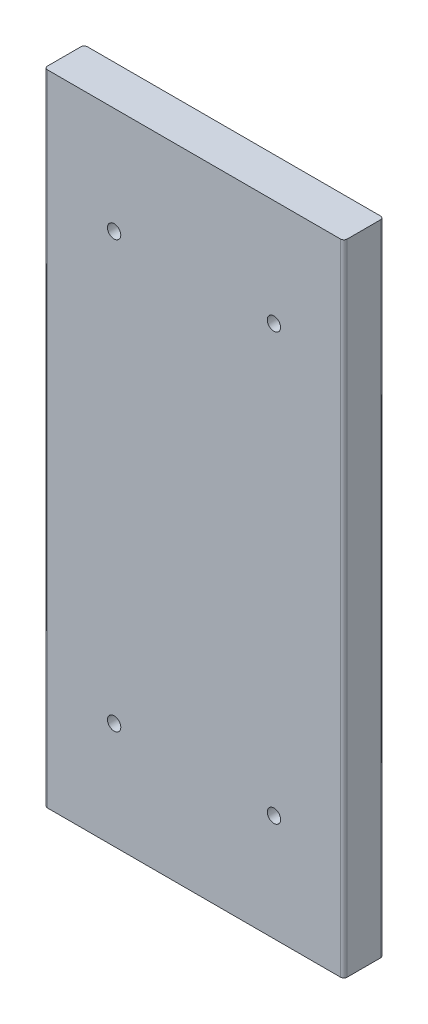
ISO-10303-21;
HEADER;
FILE_DESCRIPTION(('STEP AP214'),'2;1');
FILE_NAME('part.step','',(''),(''),'','','');
FILE_SCHEMA(('AUTOMOTIVE_DESIGN { 1 0 10303 214 1 1 1 1 }'));
ENDSEC;
DATA;
#1=APPLICATION_CONTEXT('core data for automotive mechanical design processes');
#2=APPLICATION_PROTOCOL_DEFINITION('international standard','automotive_design',2000,#1);
#3=PRODUCT_CONTEXT('',#1,'mechanical');
#4=PRODUCT('Part','Part','',(#3));
#5=PRODUCT_RELATED_PRODUCT_CATEGORY('part','',(#4));
#6=PRODUCT_DEFINITION_FORMATION('','',#4);
#7=PRODUCT_DEFINITION_CONTEXT('part definition',#1,'design');
#8=PRODUCT_DEFINITION('design','',#6,#7);
#9=PRODUCT_DEFINITION_SHAPE('','',#8);
#10=(LENGTH_UNIT() NAMED_UNIT(*) SI_UNIT(.MILLI.,.METRE.));
#11=(NAMED_UNIT(*) PLANE_ANGLE_UNIT() SI_UNIT($,.RADIAN.));
#12=(NAMED_UNIT(*) SI_UNIT($,.STERADIAN.) SOLID_ANGLE_UNIT());
#13=UNCERTAINTY_MEASURE_WITH_UNIT(LENGTH_MEASURE(1.E-05),#10,'distance_accuracy_value','');
#14=(GEOMETRIC_REPRESENTATION_CONTEXT(3) GLOBAL_UNCERTAINTY_ASSIGNED_CONTEXT((#13)) GLOBAL_UNIT_ASSIGNED_CONTEXT((#10,
#11,#12)) REPRESENTATION_CONTEXT('',''));
#15=CARTESIAN_POINT('',(0.,0.,0.));
#16=DIRECTION('',(0.,0.,1.));
#17=DIRECTION('',(1.,0.,0.));
#18=AXIS2_PLACEMENT_3D('',#15,#16,#17);
#19=CARTESIAN_POINT('',(0.,0.,38.1));
#20=DIRECTION('',(0.,0.,-1.));
#21=DIRECTION('',(-1.,0.,0.));
#22=AXIS2_PLACEMENT_3D('',#19,#20,#21);
#23=PLANE('',#22);
#24=DIRECTION('',(-1.,0.,0.));
#25=VECTOR('',#24,1.);
#26=CARTESIAN_POINT('',(0.,609.6,38.1));
#27=LINE('',#26,#25);
#28=CARTESIAN_POINT('',(282.575,609.6,38.1));
#29=VERTEX_POINT('',#28);
#30=CARTESIAN_POINT('',(3.175,609.6,38.1));
#31=VERTEX_POINT('',#30);
#32=EDGE_CURVE('E190',#29,#31,#27,.T.);
#33=ORIENTED_EDGE('',*,*,#32,.T.);
#34=DIRECTION('',(0.,-1.,0.));
#35=VECTOR('',#34,1.);
#36=CARTESIAN_POINT('',(3.175,0.,38.1));
#37=LINE('',#36,#35);
#38=CARTESIAN_POINT('',(3.175,0.,38.1));
#39=VERTEX_POINT('',#38);
#40=EDGE_CURVE('E172',#31,#39,#37,.T.);
#41=ORIENTED_EDGE('',*,*,#40,.T.);
#42=DIRECTION('',(1.,0.,0.));
#43=VECTOR('',#42,1.);
#44=CARTESIAN_POINT('',(0.,0.,38.1));
#45=LINE('',#44,#43);
#46=CARTESIAN_POINT('',(282.575,0.,38.1));
#47=VERTEX_POINT('',#46);
#48=EDGE_CURVE('E117',#39,#47,#45,.T.);
#49=ORIENTED_EDGE('',*,*,#48,.T.);
#50=DIRECTION('',(0.,1.,0.));
#51=VECTOR('',#50,1.);
#52=CARTESIAN_POINT('',(282.575,0.,38.1));
#53=LINE('',#52,#51);
#54=EDGE_CURVE('E168',#47,#29,#53,.T.);
#55=ORIENTED_EDGE('',*,*,#54,.T.);
#56=EDGE_LOOP('',(#33,#41,#49,#55));
#57=FACE_BOUND('',#56,.T.);
#58=CARTESIAN_POINT('',(66.675,508.,38.1));
#59=DIRECTION('',(0.,0.,1.));
#60=DIRECTION('',(1.,0.,0.));
#61=AXIS2_PLACEMENT_3D('',#58,#59,#60);
#62=CIRCLE('',#61,6.35000000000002);
#63=CARTESIAN_POINT('',(60.325,508.,38.1));
#64=VERTEX_POINT('',#63);
#65=EDGE_CURVE('E206',#64,#64,#62,.T.);
#66=ORIENTED_EDGE('',*,*,#65,.F.);
#67=EDGE_LOOP('',(#66));
#68=FACE_BOUND('',#67,.T.);
#69=CARTESIAN_POINT('',(66.675,101.6,38.1));
#70=DIRECTION('',(0.,0.,1.));
#71=DIRECTION('',(1.,0.,0.));
#72=AXIS2_PLACEMENT_3D('',#69,#70,#71);
#73=CIRCLE('',#72,6.35000000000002);
#74=CARTESIAN_POINT('',(60.325,101.6,38.1));
#75=VERTEX_POINT('',#74);
#76=EDGE_CURVE('E270',#75,#75,#73,.T.);
#77=ORIENTED_EDGE('',*,*,#76,.F.);
#78=EDGE_LOOP('',(#77));
#79=FACE_BOUND('',#78,.T.);
#80=CARTESIAN_POINT('',(219.075,508.,38.1));
#81=DIRECTION('',(0.,0.,1.));
#82=DIRECTION('',(1.,0.,0.));
#83=AXIS2_PLACEMENT_3D('',#80,#81,#82);
#84=CIRCLE('',#83,6.34999999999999);
#85=CARTESIAN_POINT('',(212.725,508.,38.1));
#86=VERTEX_POINT('',#85);
#87=EDGE_CURVE('E275',#86,#86,#84,.T.);
#88=ORIENTED_EDGE('',*,*,#87,.F.);
#89=EDGE_LOOP('',(#88));
#90=FACE_BOUND('',#89,.T.);
#91=CARTESIAN_POINT('',(219.075,101.6,38.1));
#92=DIRECTION('',(0.,0.,1.));
#93=DIRECTION('',(1.,0.,0.));
#94=AXIS2_PLACEMENT_3D('',#91,#92,#93);
#95=CIRCLE('',#94,6.34999999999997);
#96=CARTESIAN_POINT('',(212.725,101.6,38.1));
#97=VERTEX_POINT('',#96);
#98=EDGE_CURVE('E299',#97,#97,#95,.T.);
#99=ORIENTED_EDGE('',*,*,#98,.F.);
#100=EDGE_LOOP('',(#99));
#101=FACE_BOUND('',#100,.T.);
#102=ADVANCED_FACE('F45',(#57,#68,#79,#90,#101),#23,.F.);
#103=CARTESIAN_POINT('',(0.,0.,0.));
#104=DIRECTION('',(0.,0.,-1.));
#105=DIRECTION('',(-1.,0.,0.));
#106=AXIS2_PLACEMENT_3D('',#103,#104,#105);
#107=PLANE('',#106);
#108=CARTESIAN_POINT('',(219.075,508.,0.));
#109=DIRECTION('',(0.,0.,1.));
#110=DIRECTION('',(1.,0.,0.));
#111=AXIS2_PLACEMENT_3D('',#108,#109,#110);
#112=CIRCLE('',#111,6.34999999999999);
#113=CARTESIAN_POINT('',(212.725,508.,0.));
#114=VERTEX_POINT('',#113);
#115=EDGE_CURVE('E282',#114,#114,#112,.T.);
#116=ORIENTED_EDGE('',*,*,#115,.T.);
#117=EDGE_LOOP('',(#116));
#118=FACE_BOUND('',#117,.T.);
#119=CARTESIAN_POINT('',(66.675,508.,0.));
#120=DIRECTION('',(0.,0.,1.));
#121=DIRECTION('',(1.,0.,0.));
#122=AXIS2_PLACEMENT_3D('',#119,#120,#121);
#123=CIRCLE('',#122,6.35000000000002);
#124=CARTESIAN_POINT('',(60.325,508.,0.));
#125=VERTEX_POINT('',#124);
#126=EDGE_CURVE('E279',#125,#125,#123,.T.);
#127=ORIENTED_EDGE('',*,*,#126,.T.);
#128=EDGE_LOOP('',(#127));
#129=FACE_BOUND('',#128,.T.);
#130=DIRECTION('',(1.,0.,0.));
#131=VECTOR('',#130,1.);
#132=CARTESIAN_POINT('',(0.,0.,0.));
#133=LINE('',#132,#131);
#134=CARTESIAN_POINT('',(3.175,0.,0.));
#135=VERTEX_POINT('',#134);
#136=CARTESIAN_POINT('',(282.575,0.,0.));
#137=VERTEX_POINT('',#136);
#138=EDGE_CURVE('E203',#135,#137,#133,.T.);
#139=ORIENTED_EDGE('',*,*,#138,.F.);
#140=DIRECTION('',(0.,-1.,0.));
#141=VECTOR('',#140,1.);
#142=CARTESIAN_POINT('',(3.175,609.6,0.));
#143=LINE('',#142,#141);
#144=CARTESIAN_POINT('',(3.175,609.6,0.));
#145=VERTEX_POINT('',#144);
#146=EDGE_CURVE('E156',#135,#145,#143,.F.);
#147=ORIENTED_EDGE('',*,*,#146,.T.);
#148=DIRECTION('',(-1.,0.,0.));
#149=VECTOR('',#148,1.);
#150=CARTESIAN_POINT('',(0.,609.6,0.));
#151=LINE('',#150,#149);
#152=CARTESIAN_POINT('',(282.575,609.6,0.));
#153=VERTEX_POINT('',#152);
#154=EDGE_CURVE('E199',#153,#145,#151,.T.);
#155=ORIENTED_EDGE('',*,*,#154,.F.);
#156=DIRECTION('',(0.,1.,0.));
#157=VECTOR('',#156,1.);
#158=CARTESIAN_POINT('',(282.575,0.,0.));
#159=LINE('',#158,#157);
#160=EDGE_CURVE('E153',#153,#137,#159,.F.);
#161=ORIENTED_EDGE('',*,*,#160,.T.);
#162=EDGE_LOOP('',(#139,#147,#155,#161));
#163=FACE_BOUND('',#162,.T.);
#164=CARTESIAN_POINT('',(66.675,101.6,0.));
#165=DIRECTION('',(0.,0.,1.));
#166=DIRECTION('',(1.,0.,0.));
#167=AXIS2_PLACEMENT_3D('',#164,#165,#166);
#168=CIRCLE('',#167,6.35000000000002);
#169=CARTESIAN_POINT('',(60.325,101.6,0.));
#170=VERTEX_POINT('',#169);
#171=EDGE_CURVE('E273',#170,#170,#168,.T.);
#172=ORIENTED_EDGE('',*,*,#171,.T.);
#173=EDGE_LOOP('',(#172));
#174=FACE_BOUND('',#173,.T.);
#175=CARTESIAN_POINT('',(219.075,101.6,0.));
#176=DIRECTION('',(0.,0.,1.));
#177=DIRECTION('',(1.,0.,0.));
#178=AXIS2_PLACEMENT_3D('',#175,#176,#177);
#179=CIRCLE('',#178,6.34999999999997);
#180=CARTESIAN_POINT('',(212.725,101.6,0.));
#181=VERTEX_POINT('',#180);
#182=EDGE_CURVE('E301',#181,#181,#179,.T.);
#183=ORIENTED_EDGE('',*,*,#182,.T.);
#184=EDGE_LOOP('',(#183));
#185=FACE_BOUND('',#184,.T.);
#186=ADVANCED_FACE('F214',(#118,#129,#163,#174,#185),#107,.T.);
#187=CARTESIAN_POINT('',(0.,0.,38.1));
#188=DIRECTION('',(1.,0.,0.));
#189=DIRECTION('',(0.,0.,-1.));
#190=AXIS2_PLACEMENT_3D('',#187,#188,#189);
#191=PLANE('',#190);
#192=DIRECTION('',(0.,0.,-1.));
#193=VECTOR('',#192,1.);
#194=CARTESIAN_POINT('',(0.,609.6,38.1));
#195=LINE('',#194,#193);
#196=CARTESIAN_POINT('',(0.,609.6,34.925));
#197=VERTEX_POINT('',#196);
#198=CARTESIAN_POINT('',(0.,609.6,3.17500000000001));
#199=VERTEX_POINT('',#198);
#200=EDGE_CURVE('E194',#197,#199,#195,.T.);
#201=ORIENTED_EDGE('',*,*,#200,.T.);
#202=DIRECTION('',(0.,-1.,0.));
#203=VECTOR('',#202,1.);
#204=CARTESIAN_POINT('',(0.,0.,3.175));
#205=LINE('',#204,#203);
#206=CARTESIAN_POINT('',(0.,0.,3.17500000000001));
#207=VERTEX_POINT('',#206);
#208=EDGE_CURVE('E133',#199,#207,#205,.T.);
#209=ORIENTED_EDGE('',*,*,#208,.T.);
#210=DIRECTION('',(0.,0.,-1.));
#211=VECTOR('',#210,1.);
#212=CARTESIAN_POINT('',(0.,0.,38.1));
#213=LINE('',#212,#211);
#214=CARTESIAN_POINT('',(0.,0.,34.925));
#215=VERTEX_POINT('',#214);
#216=EDGE_CURVE('E115',#215,#207,#213,.T.);
#217=ORIENTED_EDGE('',*,*,#216,.F.);
#218=DIRECTION('',(0.,-1.,0.));
#219=VECTOR('',#218,1.);
#220=CARTESIAN_POINT('',(0.,0.,34.925));
#221=LINE('',#220,#219);
#222=EDGE_CURVE('E130',#215,#197,#221,.F.);
#223=ORIENTED_EDGE('',*,*,#222,.T.);
#224=EDGE_LOOP('',(#201,#209,#217,#223));
#225=FACE_BOUND('',#224,.T.);
#226=ADVANCED_FACE('F129',(#225),#191,.F.);
#227=CARTESIAN_POINT('',(0.,0.,38.1));
#228=DIRECTION('',(0.,1.,0.));
#229=DIRECTION('',(0.,0.,1.));
#230=AXIS2_PLACEMENT_3D('',#227,#228,#229);
#231=PLANE('',#230);
#232=ORIENTED_EDGE('',*,*,#216,.T.);
#233=CARTESIAN_POINT('',(3.175,0.,3.175));
#234=DIRECTION('',(0.,1.,0.));
#235=DIRECTION('',(0.,0.,1.));
#236=AXIS2_PLACEMENT_3D('',#233,#234,#235);
#237=CIRCLE('',#236,3.175);
#238=EDGE_CURVE('E123',#207,#135,#237,.F.);
#239=ORIENTED_EDGE('',*,*,#238,.T.);
#240=ORIENTED_EDGE('',*,*,#138,.T.);
#241=CARTESIAN_POINT('',(282.575,0.,3.175));
#242=DIRECTION('',(0.,1.,0.));
#243=DIRECTION('',(0.,0.,1.));
#244=AXIS2_PLACEMENT_3D('',#241,#242,#243);
#245=CIRCLE('',#244,3.175);
#246=CARTESIAN_POINT('',(285.75,0.,3.17500000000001));
#247=VERTEX_POINT('',#246);
#248=EDGE_CURVE('E124',#137,#247,#245,.F.);
#249=ORIENTED_EDGE('',*,*,#248,.T.);
#250=DIRECTION('',(0.,0.,-1.));
#251=VECTOR('',#250,1.);
#252=CARTESIAN_POINT('',(285.75,0.,38.1));
#253=LINE('',#252,#251);
#254=CARTESIAN_POINT('',(285.75,0.,34.925));
#255=VERTEX_POINT('',#254);
#256=EDGE_CURVE('E135',#255,#247,#253,.T.);
#257=ORIENTED_EDGE('',*,*,#256,.F.);
#258=CARTESIAN_POINT('',(282.575,0.,34.925));
#259=DIRECTION('',(0.,1.,0.));
#260=DIRECTION('',(0.,0.,1.));
#261=AXIS2_PLACEMENT_3D('',#258,#259,#260);
#262=CIRCLE('',#261,3.175);
#263=EDGE_CURVE('E143',#255,#47,#262,.F.);
#264=ORIENTED_EDGE('',*,*,#263,.T.);
#265=ORIENTED_EDGE('',*,*,#48,.F.);
#266=CARTESIAN_POINT('',(3.175,0.,34.925));
#267=DIRECTION('',(0.,1.,0.));
#268=DIRECTION('',(0.,0.,1.));
#269=AXIS2_PLACEMENT_3D('',#266,#267,#268);
#270=CIRCLE('',#269,3.175);
#271=EDGE_CURVE('E112',#39,#215,#270,.F.);
#272=ORIENTED_EDGE('',*,*,#271,.T.);
#273=EDGE_LOOP('',(#232,#239,#240,#249,#257,#264,#265,#272));
#274=FACE_BOUND('',#273,.T.);
#275=ADVANCED_FACE('F114',(#274),#231,.F.);
#276=CARTESIAN_POINT('',(285.75,0.,38.1));
#277=DIRECTION('',(-1.,0.,0.));
#278=DIRECTION('',(0.,0.,1.));
#279=AXIS2_PLACEMENT_3D('',#276,#277,#278);
#280=PLANE('',#279);
#281=ORIENTED_EDGE('',*,*,#256,.T.);
#282=DIRECTION('',(0.,1.,0.));
#283=VECTOR('',#282,1.);
#284=CARTESIAN_POINT('',(285.75,609.6,3.175));
#285=LINE('',#284,#283);
#286=CARTESIAN_POINT('',(285.75,609.6,3.17500000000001));
#287=VERTEX_POINT('',#286);
#288=EDGE_CURVE('E11',#247,#287,#285,.T.);
#289=ORIENTED_EDGE('',*,*,#288,.T.);
#290=DIRECTION('',(0.,0.,-1.));
#291=VECTOR('',#290,1.);
#292=CARTESIAN_POINT('',(285.75,609.6,38.1));
#293=LINE('',#292,#291);
#294=CARTESIAN_POINT('',(285.75,609.6,34.925));
#295=VERTEX_POINT('',#294);
#296=EDGE_CURVE('E180',#295,#287,#293,.T.);
#297=ORIENTED_EDGE('',*,*,#296,.F.);
#298=DIRECTION('',(0.,1.,0.));
#299=VECTOR('',#298,1.);
#300=CARTESIAN_POINT('',(285.75,0.,34.925));
#301=LINE('',#300,#299);
#302=EDGE_CURVE('E54',#295,#255,#301,.F.);
#303=ORIENTED_EDGE('',*,*,#302,.T.);
#304=EDGE_LOOP('',(#281,#289,#297,#303));
#305=FACE_BOUND('',#304,.T.);
#306=ADVANCED_FACE('F179',(#305),#280,.F.);
#307=CARTESIAN_POINT('',(0.,609.6,38.1));
#308=DIRECTION('',(0.,-1.,0.));
#309=DIRECTION('',(0.,0.,-1.));
#310=AXIS2_PLACEMENT_3D('',#307,#308,#309);
#311=PLANE('',#310);
#312=ORIENTED_EDGE('',*,*,#154,.T.);
#313=CARTESIAN_POINT('',(3.175,609.6,3.175));
#314=DIRECTION('',(0.,-1.,0.));
#315=DIRECTION('',(0.,0.,-1.));
#316=AXIS2_PLACEMENT_3D('',#313,#314,#315);
#317=CIRCLE('',#316,3.175);
#318=EDGE_CURVE('E165',#145,#199,#317,.F.);
#319=ORIENTED_EDGE('',*,*,#318,.T.);
#320=ORIENTED_EDGE('',*,*,#200,.F.);
#321=CARTESIAN_POINT('',(3.175,609.6,34.925));
#322=DIRECTION('',(0.,-1.,0.));
#323=DIRECTION('',(0.,0.,-1.));
#324=AXIS2_PLACEMENT_3D('',#321,#322,#323);
#325=CIRCLE('',#324,3.175);
#326=EDGE_CURVE('E139',#197,#31,#325,.F.);
#327=ORIENTED_EDGE('',*,*,#326,.T.);
#328=ORIENTED_EDGE('',*,*,#32,.F.);
#329=CARTESIAN_POINT('',(282.575,609.6,34.925));
#330=DIRECTION('',(0.,-1.,0.));
#331=DIRECTION('',(0.,0.,-1.));
#332=AXIS2_PLACEMENT_3D('',#329,#330,#331);
#333=CIRCLE('',#332,3.175);
#334=EDGE_CURVE('E68',#29,#295,#333,.F.);
#335=ORIENTED_EDGE('',*,*,#334,.T.);
#336=ORIENTED_EDGE('',*,*,#296,.T.);
#337=CARTESIAN_POINT('',(282.575,609.6,3.175));
#338=DIRECTION('',(0.,-1.,0.));
#339=DIRECTION('',(0.,0.,-1.));
#340=AXIS2_PLACEMENT_3D('',#337,#338,#339);
#341=CIRCLE('',#340,3.175);
#342=EDGE_CURVE('E61',#287,#153,#341,.F.);
#343=ORIENTED_EDGE('',*,*,#342,.T.);
#344=EDGE_LOOP('',(#312,#319,#320,#327,#328,#335,#336,#343));
#345=FACE_BOUND('',#344,.T.);
#346=ADVANCED_FACE('F192',(#345),#311,.F.);
#347=CARTESIAN_POINT('',(66.675,508.,38.1));
#348=DIRECTION('',(0.,0.,-1.));
#349=DIRECTION('',(-1.,0.,0.));
#350=AXIS2_PLACEMENT_3D('',#347,#348,#349);
#351=CYLINDRICAL_SURFACE('',#350,6.35000000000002);
#352=CARTESIAN_POINT('',(60.325,508.,38.1));
#353=CARTESIAN_POINT('',(60.325,508.,37.703125));
#354=CARTESIAN_POINT('',(60.325,508.,37.30625));
#355=CARTESIAN_POINT('',(60.325,508.,36.5125));
#356=CARTESIAN_POINT('',(60.325,508.,36.115625));
#357=CARTESIAN_POINT('',(60.325,508.,35.321875));
#358=CARTESIAN_POINT('',(60.325,508.,34.925));
#359=CARTESIAN_POINT('',(60.325,508.,34.13125));
#360=CARTESIAN_POINT('',(60.325,508.,33.734375));
#361=CARTESIAN_POINT('',(60.325,508.,32.940625));
#362=CARTESIAN_POINT('',(60.325,508.,32.54375));
#363=CARTESIAN_POINT('',(60.325,508.,31.75));
#364=CARTESIAN_POINT('',(60.325,508.,31.353125));
#365=CARTESIAN_POINT('',(60.325,508.,30.559375));
#366=CARTESIAN_POINT('',(60.325,508.,30.1625));
#367=CARTESIAN_POINT('',(60.325,508.,29.36875));
#368=CARTESIAN_POINT('',(60.325,508.,28.971875));
#369=CARTESIAN_POINT('',(60.325,508.,28.178125));
#370=CARTESIAN_POINT('',(60.325,508.,27.78125));
#371=CARTESIAN_POINT('',(60.325,508.,26.9875));
#372=CARTESIAN_POINT('',(60.325,508.,26.590625));
#373=CARTESIAN_POINT('',(60.325,508.,25.796875));
#374=CARTESIAN_POINT('',(60.325,508.,25.4));
#375=CARTESIAN_POINT('',(60.325,508.,24.60625));
#376=CARTESIAN_POINT('',(60.325,508.,24.209375));
#377=CARTESIAN_POINT('',(60.325,508.,23.415625));
#378=CARTESIAN_POINT('',(60.325,508.,23.01875));
#379=CARTESIAN_POINT('',(60.325,508.,22.225));
#380=CARTESIAN_POINT('',(60.325,508.,21.828125));
#381=CARTESIAN_POINT('',(60.325,508.,21.034375));
#382=CARTESIAN_POINT('',(60.325,508.,20.6375));
#383=CARTESIAN_POINT('',(60.325,508.,19.84375));
#384=CARTESIAN_POINT('',(60.325,508.,19.446875));
#385=CARTESIAN_POINT('',(60.325,508.,18.653125));
#386=CARTESIAN_POINT('',(60.325,508.,18.25625));
#387=CARTESIAN_POINT('',(60.325,508.,17.4625));
#388=CARTESIAN_POINT('',(60.325,508.,17.065625));
#389=CARTESIAN_POINT('',(60.325,508.,16.271875));
#390=CARTESIAN_POINT('',(60.325,508.,15.875));
#391=CARTESIAN_POINT('',(60.325,508.,15.08125));
#392=CARTESIAN_POINT('',(60.325,508.,14.684375));
#393=CARTESIAN_POINT('',(60.325,508.,13.890625));
#394=CARTESIAN_POINT('',(60.325,508.,13.49375));
#395=CARTESIAN_POINT('',(60.325,508.,12.7));
#396=CARTESIAN_POINT('',(60.325,508.,12.303125));
#397=CARTESIAN_POINT('',(60.325,508.,11.509375));
#398=CARTESIAN_POINT('',(60.325,508.,11.1125));
#399=CARTESIAN_POINT('',(60.325,508.,10.31875));
#400=CARTESIAN_POINT('',(60.325,508.,9.921875));
#401=CARTESIAN_POINT('',(60.325,508.,9.128125));
#402=CARTESIAN_POINT('',(60.325,508.,8.73125));
#403=CARTESIAN_POINT('',(60.325,508.,7.9375));
#404=CARTESIAN_POINT('',(60.325,508.,7.540625));
#405=CARTESIAN_POINT('',(60.325,508.,6.746875));
#406=CARTESIAN_POINT('',(60.325,508.,6.35));
#407=CARTESIAN_POINT('',(60.325,508.,5.55625));
#408=CARTESIAN_POINT('',(60.325,508.,5.159375));
#409=CARTESIAN_POINT('',(60.325,508.,4.365625));
#410=CARTESIAN_POINT('',(60.325,508.,3.96875));
#411=CARTESIAN_POINT('',(60.325,508.,3.175));
#412=CARTESIAN_POINT('',(60.325,508.,2.778125));
#413=CARTESIAN_POINT('',(60.325,508.,1.984375));
#414=CARTESIAN_POINT('',(60.325,508.,1.5875));
#415=CARTESIAN_POINT('',(60.325,508.,0.79375));
#416=CARTESIAN_POINT('',(60.325,508.,0.396875));
#417=CARTESIAN_POINT('',(60.325,508.,0.));
#418=B_SPLINE_CURVE_WITH_KNOTS('',3,(#352,#353,#354,#355,#356,#357,#358,#359,#360,#361,#362,
#363,#364,#365,#366,#367,#368,#369,#370,#371,#372,#373,#374,#375,#376,#377,#378,#379,#380,#381,
#382,#383,#384,#385,#386,#387,#388,#389,#390,#391,#392,#393,#394,#395,#396,#397,#398,#399,#400,
#401,#402,#403,#404,#405,#406,#407,#408,#409,#410,#411,#412,#413,#414,#415,#416,#417),
.UNSPECIFIED.,.F.,.F.,(4,2,2,2,2,2,2,2,2,2,2,2,2,2,2,2,2,2,2,2,2,2,2,2,2,2,2,2,2,2,2,2,4),(0.,
1.19062499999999,2.38124999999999,3.571875,4.7625,5.953125,7.14375,8.33437499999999,9.525,
10.715625,11.90625,13.096875,14.2875,15.478125,16.66875,17.859375,19.05,20.240625,21.43125,
22.621875,23.8125,25.003125,26.19375,27.384375,28.575,29.765625,30.95625,32.146875,33.3375,
34.528125,35.71875,36.909375,38.1),.UNSPECIFIED.);
#419=EDGE_CURVE('BSEAM234',#64,#125,#418,.T.);
#420=ORIENTED_EDGE('',*,*,#65,.T.);
#421=ORIENTED_EDGE('',*,*,#126,.F.);
#422=ORIENTED_EDGE('',*,*,#419,.T.);
#423=ORIENTED_EDGE('',*,*,#419,.F.);
#424=EDGE_LOOP('',(#420,#422,#421,#423));
#425=FACE_BOUND('',#424,.T.);
#426=ADVANCED_FACE('F234',(#425),#351,.F.);
#427=CARTESIAN_POINT('',(66.675,101.6,38.1));
#428=DIRECTION('',(0.,0.,-1.));
#429=DIRECTION('',(-1.,0.,0.));
#430=AXIS2_PLACEMENT_3D('',#427,#428,#429);
#431=CYLINDRICAL_SURFACE('',#430,6.35000000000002);
#432=CARTESIAN_POINT('',(60.325,101.6,38.1));
#433=CARTESIAN_POINT('',(60.325,101.6,37.703125));
#434=CARTESIAN_POINT('',(60.325,101.6,37.30625));
#435=CARTESIAN_POINT('',(60.325,101.6,36.5125));
#436=CARTESIAN_POINT('',(60.325,101.6,36.115625));
#437=CARTESIAN_POINT('',(60.325,101.6,35.321875));
#438=CARTESIAN_POINT('',(60.325,101.6,34.925));
#439=CARTESIAN_POINT('',(60.325,101.6,34.13125));
#440=CARTESIAN_POINT('',(60.325,101.6,33.734375));
#441=CARTESIAN_POINT('',(60.325,101.6,32.940625));
#442=CARTESIAN_POINT('',(60.325,101.6,32.54375));
#443=CARTESIAN_POINT('',(60.325,101.6,31.75));
#444=CARTESIAN_POINT('',(60.325,101.6,31.353125));
#445=CARTESIAN_POINT('',(60.325,101.6,30.559375));
#446=CARTESIAN_POINT('',(60.325,101.6,30.1625));
#447=CARTESIAN_POINT('',(60.325,101.6,29.36875));
#448=CARTESIAN_POINT('',(60.325,101.6,28.971875));
#449=CARTESIAN_POINT('',(60.325,101.6,28.178125));
#450=CARTESIAN_POINT('',(60.325,101.6,27.78125));
#451=CARTESIAN_POINT('',(60.325,101.6,26.9875));
#452=CARTESIAN_POINT('',(60.325,101.6,26.590625));
#453=CARTESIAN_POINT('',(60.325,101.6,25.796875));
#454=CARTESIAN_POINT('',(60.325,101.6,25.4));
#455=CARTESIAN_POINT('',(60.325,101.6,24.60625));
#456=CARTESIAN_POINT('',(60.325,101.6,24.209375));
#457=CARTESIAN_POINT('',(60.325,101.6,23.415625));
#458=CARTESIAN_POINT('',(60.325,101.6,23.01875));
#459=CARTESIAN_POINT('',(60.325,101.6,22.225));
#460=CARTESIAN_POINT('',(60.325,101.6,21.828125));
#461=CARTESIAN_POINT('',(60.325,101.6,21.034375));
#462=CARTESIAN_POINT('',(60.325,101.6,20.6375));
#463=CARTESIAN_POINT('',(60.325,101.6,19.84375));
#464=CARTESIAN_POINT('',(60.325,101.6,19.446875));
#465=CARTESIAN_POINT('',(60.325,101.6,18.653125));
#466=CARTESIAN_POINT('',(60.325,101.6,18.25625));
#467=CARTESIAN_POINT('',(60.325,101.6,17.4625));
#468=CARTESIAN_POINT('',(60.325,101.6,17.065625));
#469=CARTESIAN_POINT('',(60.325,101.6,16.271875));
#470=CARTESIAN_POINT('',(60.325,101.6,15.875));
#471=CARTESIAN_POINT('',(60.325,101.6,15.08125));
#472=CARTESIAN_POINT('',(60.325,101.6,14.684375));
#473=CARTESIAN_POINT('',(60.325,101.6,13.890625));
#474=CARTESIAN_POINT('',(60.325,101.6,13.49375));
#475=CARTESIAN_POINT('',(60.325,101.6,12.7));
#476=CARTESIAN_POINT('',(60.325,101.6,12.303125));
#477=CARTESIAN_POINT('',(60.325,101.6,11.509375));
#478=CARTESIAN_POINT('',(60.325,101.6,11.1125));
#479=CARTESIAN_POINT('',(60.325,101.6,10.31875));
#480=CARTESIAN_POINT('',(60.325,101.6,9.921875));
#481=CARTESIAN_POINT('',(60.325,101.6,9.128125));
#482=CARTESIAN_POINT('',(60.325,101.6,8.73125));
#483=CARTESIAN_POINT('',(60.325,101.6,7.9375));
#484=CARTESIAN_POINT('',(60.325,101.6,7.540625));
#485=CARTESIAN_POINT('',(60.325,101.6,6.746875));
#486=CARTESIAN_POINT('',(60.325,101.6,6.35));
#487=CARTESIAN_POINT('',(60.325,101.6,5.55625));
#488=CARTESIAN_POINT('',(60.325,101.6,5.159375));
#489=CARTESIAN_POINT('',(60.325,101.6,4.365625));
#490=CARTESIAN_POINT('',(60.325,101.6,3.96875));
#491=CARTESIAN_POINT('',(60.325,101.6,3.175));
#492=CARTESIAN_POINT('',(60.325,101.6,2.778125));
#493=CARTESIAN_POINT('',(60.325,101.6,1.984375));
#494=CARTESIAN_POINT('',(60.325,101.6,1.5875));
#495=CARTESIAN_POINT('',(60.325,101.6,0.79375));
#496=CARTESIAN_POINT('',(60.325,101.6,0.396875));
#497=CARTESIAN_POINT('',(60.325,101.6,0.));
#498=B_SPLINE_CURVE_WITH_KNOTS('',3,(#432,#433,#434,#435,#436,#437,#438,#439,#440,#441,#442,
#443,#444,#445,#446,#447,#448,#449,#450,#451,#452,#453,#454,#455,#456,#457,#458,#459,#460,#461,
#462,#463,#464,#465,#466,#467,#468,#469,#470,#471,#472,#473,#474,#475,#476,#477,#478,#479,#480,
#481,#482,#483,#484,#485,#486,#487,#488,#489,#490,#491,#492,#493,#494,#495,#496,#497),
.UNSPECIFIED.,.F.,.F.,(4,2,2,2,2,2,2,2,2,2,2,2,2,2,2,2,2,2,2,2,2,2,2,2,2,2,2,2,2,2,2,2,4),(0.,
1.19062499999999,2.38124999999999,3.571875,4.7625,5.953125,7.14375,8.33437499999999,9.525,
10.715625,11.90625,13.096875,14.2875,15.478125,16.66875,17.859375,19.05,20.240625,21.43125,
22.621875,23.8125,25.003125,26.19375,27.384375,28.575,29.765625,30.95625,32.146875,33.3375,
34.528125,35.71875,36.909375,38.1),.UNSPECIFIED.);
#499=EDGE_CURVE('BSEAM256',#75,#170,#498,.T.);
#500=ORIENTED_EDGE('',*,*,#76,.T.);
#501=ORIENTED_EDGE('',*,*,#171,.F.);
#502=ORIENTED_EDGE('',*,*,#499,.T.);
#503=ORIENTED_EDGE('',*,*,#499,.F.);
#504=EDGE_LOOP('',(#500,#502,#501,#503));
#505=FACE_BOUND('',#504,.T.);
#506=ADVANCED_FACE('F256',(#505),#431,.F.);
#507=CARTESIAN_POINT('',(219.075,508.,38.1));
#508=DIRECTION('',(0.,0.,-1.));
#509=DIRECTION('',(-1.,0.,0.));
#510=AXIS2_PLACEMENT_3D('',#507,#508,#509);
#511=CYLINDRICAL_SURFACE('',#510,6.34999999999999);
#512=CARTESIAN_POINT('',(212.725,508.,38.1));
#513=CARTESIAN_POINT('',(212.725,508.,37.703125));
#514=CARTESIAN_POINT('',(212.725,508.,37.30625));
#515=CARTESIAN_POINT('',(212.725,508.,36.5125));
#516=CARTESIAN_POINT('',(212.725,508.,36.115625));
#517=CARTESIAN_POINT('',(212.725,508.,35.321875));
#518=CARTESIAN_POINT('',(212.725,508.,34.925));
#519=CARTESIAN_POINT('',(212.725,508.,34.13125));
#520=CARTESIAN_POINT('',(212.725,508.,33.734375));
#521=CARTESIAN_POINT('',(212.725,508.,32.940625));
#522=CARTESIAN_POINT('',(212.725,508.,32.54375));
#523=CARTESIAN_POINT('',(212.725,508.,31.75));
#524=CARTESIAN_POINT('',(212.725,508.,31.353125));
#525=CARTESIAN_POINT('',(212.725,508.,30.559375));
#526=CARTESIAN_POINT('',(212.725,508.,30.1625));
#527=CARTESIAN_POINT('',(212.725,508.,29.36875));
#528=CARTESIAN_POINT('',(212.725,508.,28.971875));
#529=CARTESIAN_POINT('',(212.725,508.,28.178125));
#530=CARTESIAN_POINT('',(212.725,508.,27.78125));
#531=CARTESIAN_POINT('',(212.725,508.,26.9875));
#532=CARTESIAN_POINT('',(212.725,508.,26.590625));
#533=CARTESIAN_POINT('',(212.725,508.,25.796875));
#534=CARTESIAN_POINT('',(212.725,508.,25.4));
#535=CARTESIAN_POINT('',(212.725,508.,24.60625));
#536=CARTESIAN_POINT('',(212.725,508.,24.209375));
#537=CARTESIAN_POINT('',(212.725,508.,23.415625));
#538=CARTESIAN_POINT('',(212.725,508.,23.01875));
#539=CARTESIAN_POINT('',(212.725,508.,22.225));
#540=CARTESIAN_POINT('',(212.725,508.,21.828125));
#541=CARTESIAN_POINT('',(212.725,508.,21.034375));
#542=CARTESIAN_POINT('',(212.725,508.,20.6375));
#543=CARTESIAN_POINT('',(212.725,508.,19.84375));
#544=CARTESIAN_POINT('',(212.725,508.,19.446875));
#545=CARTESIAN_POINT('',(212.725,508.,18.653125));
#546=CARTESIAN_POINT('',(212.725,508.,18.25625));
#547=CARTESIAN_POINT('',(212.725,508.,17.4625));
#548=CARTESIAN_POINT('',(212.725,508.,17.065625));
#549=CARTESIAN_POINT('',(212.725,508.,16.271875));
#550=CARTESIAN_POINT('',(212.725,508.,15.875));
#551=CARTESIAN_POINT('',(212.725,508.,15.08125));
#552=CARTESIAN_POINT('',(212.725,508.,14.684375));
#553=CARTESIAN_POINT('',(212.725,508.,13.890625));
#554=CARTESIAN_POINT('',(212.725,508.,13.49375));
#555=CARTESIAN_POINT('',(212.725,508.,12.7));
#556=CARTESIAN_POINT('',(212.725,508.,12.303125));
#557=CARTESIAN_POINT('',(212.725,508.,11.509375));
#558=CARTESIAN_POINT('',(212.725,508.,11.1125));
#559=CARTESIAN_POINT('',(212.725,508.,10.31875));
#560=CARTESIAN_POINT('',(212.725,508.,9.921875));
#561=CARTESIAN_POINT('',(212.725,508.,9.128125));
#562=CARTESIAN_POINT('',(212.725,508.,8.73125));
#563=CARTESIAN_POINT('',(212.725,508.,7.9375));
#564=CARTESIAN_POINT('',(212.725,508.,7.540625));
#565=CARTESIAN_POINT('',(212.725,508.,6.746875));
#566=CARTESIAN_POINT('',(212.725,508.,6.35));
#567=CARTESIAN_POINT('',(212.725,508.,5.55625));
#568=CARTESIAN_POINT('',(212.725,508.,5.159375));
#569=CARTESIAN_POINT('',(212.725,508.,4.365625));
#570=CARTESIAN_POINT('',(212.725,508.,3.96875));
#571=CARTESIAN_POINT('',(212.725,508.,3.175));
#572=CARTESIAN_POINT('',(212.725,508.,2.778125));
#573=CARTESIAN_POINT('',(212.725,508.,1.984375));
#574=CARTESIAN_POINT('',(212.725,508.,1.5875));
#575=CARTESIAN_POINT('',(212.725,508.,0.79375));
#576=CARTESIAN_POINT('',(212.725,508.,0.396875));
#577=CARTESIAN_POINT('',(212.725,508.,0.));
#578=B_SPLINE_CURVE_WITH_KNOTS('',3,(#512,#513,#514,#515,#516,#517,#518,#519,#520,#521,#522,
#523,#524,#525,#526,#527,#528,#529,#530,#531,#532,#533,#534,#535,#536,#537,#538,#539,#540,#541,
#542,#543,#544,#545,#546,#547,#548,#549,#550,#551,#552,#553,#554,#555,#556,#557,#558,#559,#560,
#561,#562,#563,#564,#565,#566,#567,#568,#569,#570,#571,#572,#573,#574,#575,#576,#577),
.UNSPECIFIED.,.F.,.F.,(4,2,2,2,2,2,2,2,2,2,2,2,2,2,2,2,2,2,2,2,2,2,2,2,2,2,2,2,2,2,2,2,4),(0.,
1.19062499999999,2.38124999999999,3.571875,4.7625,5.953125,7.14375,8.33437499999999,9.525,
10.715625,11.90625,13.096875,14.2875,15.478125,16.66875,17.859375,19.05,20.240625,21.43125,
22.621875,23.8125,25.003125,26.19375,27.384375,28.575,29.765625,30.95625,32.146875,33.3375,
34.528125,35.71875,36.909375,38.1),.UNSPECIFIED.);
#579=EDGE_CURVE('BSEAM250',#86,#114,#578,.T.);
#580=ORIENTED_EDGE('',*,*,#87,.T.);
#581=ORIENTED_EDGE('',*,*,#115,.F.);
#582=ORIENTED_EDGE('',*,*,#579,.T.);
#583=ORIENTED_EDGE('',*,*,#579,.F.);
#584=EDGE_LOOP('',(#580,#582,#581,#583));
#585=FACE_BOUND('',#584,.T.);
#586=ADVANCED_FACE('F250',(#585),#511,.F.);
#587=CARTESIAN_POINT('',(219.075,101.6,38.1));
#588=DIRECTION('',(0.,0.,-1.));
#589=DIRECTION('',(-1.,0.,0.));
#590=AXIS2_PLACEMENT_3D('',#587,#588,#589);
#591=CYLINDRICAL_SURFACE('',#590,6.34999999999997);
#592=CARTESIAN_POINT('',(212.725,101.6,38.1));
#593=CARTESIAN_POINT('',(212.725,101.6,37.703125));
#594=CARTESIAN_POINT('',(212.725,101.6,37.30625));
#595=CARTESIAN_POINT('',(212.725,101.6,36.5125));
#596=CARTESIAN_POINT('',(212.725,101.6,36.115625));
#597=CARTESIAN_POINT('',(212.725,101.6,35.321875));
#598=CARTESIAN_POINT('',(212.725,101.6,34.925));
#599=CARTESIAN_POINT('',(212.725,101.6,34.13125));
#600=CARTESIAN_POINT('',(212.725,101.6,33.734375));
#601=CARTESIAN_POINT('',(212.725,101.6,32.940625));
#602=CARTESIAN_POINT('',(212.725,101.6,32.54375));
#603=CARTESIAN_POINT('',(212.725,101.6,31.75));
#604=CARTESIAN_POINT('',(212.725,101.6,31.353125));
#605=CARTESIAN_POINT('',(212.725,101.6,30.559375));
#606=CARTESIAN_POINT('',(212.725,101.6,30.1625));
#607=CARTESIAN_POINT('',(212.725,101.6,29.36875));
#608=CARTESIAN_POINT('',(212.725,101.6,28.971875));
#609=CARTESIAN_POINT('',(212.725,101.6,28.178125));
#610=CARTESIAN_POINT('',(212.725,101.6,27.78125));
#611=CARTESIAN_POINT('',(212.725,101.6,26.9875));
#612=CARTESIAN_POINT('',(212.725,101.6,26.590625));
#613=CARTESIAN_POINT('',(212.725,101.6,25.796875));
#614=CARTESIAN_POINT('',(212.725,101.6,25.4));
#615=CARTESIAN_POINT('',(212.725,101.6,24.60625));
#616=CARTESIAN_POINT('',(212.725,101.6,24.209375));
#617=CARTESIAN_POINT('',(212.725,101.6,23.415625));
#618=CARTESIAN_POINT('',(212.725,101.6,23.01875));
#619=CARTESIAN_POINT('',(212.725,101.6,22.225));
#620=CARTESIAN_POINT('',(212.725,101.6,21.828125));
#621=CARTESIAN_POINT('',(212.725,101.6,21.034375));
#622=CARTESIAN_POINT('',(212.725,101.6,20.6375));
#623=CARTESIAN_POINT('',(212.725,101.6,19.84375));
#624=CARTESIAN_POINT('',(212.725,101.6,19.446875));
#625=CARTESIAN_POINT('',(212.725,101.6,18.653125));
#626=CARTESIAN_POINT('',(212.725,101.6,18.25625));
#627=CARTESIAN_POINT('',(212.725,101.6,17.4625));
#628=CARTESIAN_POINT('',(212.725,101.6,17.065625));
#629=CARTESIAN_POINT('',(212.725,101.6,16.271875));
#630=CARTESIAN_POINT('',(212.725,101.6,15.875));
#631=CARTESIAN_POINT('',(212.725,101.6,15.08125));
#632=CARTESIAN_POINT('',(212.725,101.6,14.684375));
#633=CARTESIAN_POINT('',(212.725,101.6,13.890625));
#634=CARTESIAN_POINT('',(212.725,101.6,13.49375));
#635=CARTESIAN_POINT('',(212.725,101.6,12.7));
#636=CARTESIAN_POINT('',(212.725,101.6,12.303125));
#637=CARTESIAN_POINT('',(212.725,101.6,11.509375));
#638=CARTESIAN_POINT('',(212.725,101.6,11.1125));
#639=CARTESIAN_POINT('',(212.725,101.6,10.31875));
#640=CARTESIAN_POINT('',(212.725,101.6,9.921875));
#641=CARTESIAN_POINT('',(212.725,101.6,9.128125));
#642=CARTESIAN_POINT('',(212.725,101.6,8.73125));
#643=CARTESIAN_POINT('',(212.725,101.6,7.9375));
#644=CARTESIAN_POINT('',(212.725,101.6,7.540625));
#645=CARTESIAN_POINT('',(212.725,101.6,6.746875));
#646=CARTESIAN_POINT('',(212.725,101.6,6.35));
#647=CARTESIAN_POINT('',(212.725,101.6,5.55625));
#648=CARTESIAN_POINT('',(212.725,101.6,5.159375));
#649=CARTESIAN_POINT('',(212.725,101.6,4.365625));
#650=CARTESIAN_POINT('',(212.725,101.6,3.96875));
#651=CARTESIAN_POINT('',(212.725,101.6,3.175));
#652=CARTESIAN_POINT('',(212.725,101.6,2.778125));
#653=CARTESIAN_POINT('',(212.725,101.6,1.984375));
#654=CARTESIAN_POINT('',(212.725,101.6,1.5875));
#655=CARTESIAN_POINT('',(212.725,101.6,0.79375));
#656=CARTESIAN_POINT('',(212.725,101.6,0.396875));
#657=CARTESIAN_POINT('',(212.725,101.6,0.));
#658=B_SPLINE_CURVE_WITH_KNOTS('',3,(#592,#593,#594,#595,#596,#597,#598,#599,#600,#601,#602,
#603,#604,#605,#606,#607,#608,#609,#610,#611,#612,#613,#614,#615,#616,#617,#618,#619,#620,#621,
#622,#623,#624,#625,#626,#627,#628,#629,#630,#631,#632,#633,#634,#635,#636,#637,#638,#639,#640,
#641,#642,#643,#644,#645,#646,#647,#648,#649,#650,#651,#652,#653,#654,#655,#656,#657),
.UNSPECIFIED.,.F.,.F.,(4,2,2,2,2,2,2,2,2,2,2,2,2,2,2,2,2,2,2,2,2,2,2,2,2,2,2,2,2,2,2,2,4),(0.,
1.19062499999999,2.38124999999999,3.571875,4.7625,5.953125,7.14375,8.33437499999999,9.525,
10.715625,11.90625,13.096875,14.2875,15.478125,16.66875,17.859375,19.05,20.240625,21.43125,
22.621875,23.8125,25.003125,26.19375,27.384375,28.575,29.765625,30.95625,32.146875,33.3375,
34.528125,35.71875,36.909375,38.1),.UNSPECIFIED.);
#659=EDGE_CURVE('BSEAM246',#97,#181,#658,.T.);
#660=ORIENTED_EDGE('',*,*,#98,.T.);
#661=ORIENTED_EDGE('',*,*,#182,.F.);
#662=ORIENTED_EDGE('',*,*,#659,.T.);
#663=ORIENTED_EDGE('',*,*,#659,.F.);
#664=EDGE_LOOP('',(#660,#662,#661,#663));
#665=FACE_BOUND('',#664,.T.);
#666=ADVANCED_FACE('F246',(#665),#591,.F.);
#667=CARTESIAN_POINT('',(3.175,0.,3.175));
#668=DIRECTION('',(0.,1.,0.));
#669=DIRECTION('',(0.,0.,1.));
#670=AXIS2_PLACEMENT_3D('',#667,#668,#669);
#671=CYLINDRICAL_SURFACE('',#670,3.175);
#672=ORIENTED_EDGE('',*,*,#318,.F.);
#673=ORIENTED_EDGE('',*,*,#146,.F.);
#674=ORIENTED_EDGE('',*,*,#238,.F.);
#675=ORIENTED_EDGE('',*,*,#208,.F.);
#676=EDGE_LOOP('',(#672,#673,#674,#675));
#677=FACE_BOUND('',#676,.T.);
#678=ADVANCED_FACE('F223',(#677),#671,.T.);
#679=CARTESIAN_POINT('',(3.175,0.,34.925));
#680=DIRECTION('',(0.,-1.,0.));
#681=DIRECTION('',(0.,0.,-1.));
#682=AXIS2_PLACEMENT_3D('',#679,#680,#681);
#683=CYLINDRICAL_SURFACE('',#682,3.175);
#684=ORIENTED_EDGE('',*,*,#326,.F.);
#685=ORIENTED_EDGE('',*,*,#222,.F.);
#686=ORIENTED_EDGE('',*,*,#271,.F.);
#687=ORIENTED_EDGE('',*,*,#40,.F.);
#688=EDGE_LOOP('',(#684,#685,#686,#687));
#689=FACE_BOUND('',#688,.T.);
#690=ADVANCED_FACE('F138',(#689),#683,.T.);
#691=CARTESIAN_POINT('',(282.575,0.,3.175));
#692=DIRECTION('',(0.,-1.,0.));
#693=DIRECTION('',(0.,0.,-1.));
#694=AXIS2_PLACEMENT_3D('',#691,#692,#693);
#695=CYLINDRICAL_SURFACE('',#694,3.175);
#696=ORIENTED_EDGE('',*,*,#248,.F.);
#697=ORIENTED_EDGE('',*,*,#160,.F.);
#698=ORIENTED_EDGE('',*,*,#342,.F.);
#699=ORIENTED_EDGE('',*,*,#288,.F.);
#700=EDGE_LOOP('',(#696,#697,#698,#699));
#701=FACE_BOUND('',#700,.T.);
#702=ADVANCED_FACE('F217',(#701),#695,.T.);
#703=CARTESIAN_POINT('',(282.575,0.,34.925));
#704=DIRECTION('',(0.,1.,0.));
#705=DIRECTION('',(0.,0.,1.));
#706=AXIS2_PLACEMENT_3D('',#703,#704,#705);
#707=CYLINDRICAL_SURFACE('',#706,3.175);
#708=ORIENTED_EDGE('',*,*,#263,.F.);
#709=ORIENTED_EDGE('',*,*,#302,.F.);
#710=ORIENTED_EDGE('',*,*,#334,.F.);
#711=ORIENTED_EDGE('',*,*,#54,.F.);
#712=EDGE_LOOP('',(#708,#709,#710,#711));
#713=FACE_BOUND('',#712,.T.);
#714=ADVANCED_FACE('F47',(#713),#707,.T.);
#715=CLOSED_SHELL('',(#102,#186,#226,#275,#306,#346,#426,#506,#586,#666,#678,#690,#702,#714));
#716=MANIFOLD_SOLID_BREP('B2',#715);
#717=ADVANCED_BREP_SHAPE_REPRESENTATION('',(#18,#716),#14);
#718=SHAPE_DEFINITION_REPRESENTATION(#9,#717);
ENDSEC;
END-ISO-10303-21;
